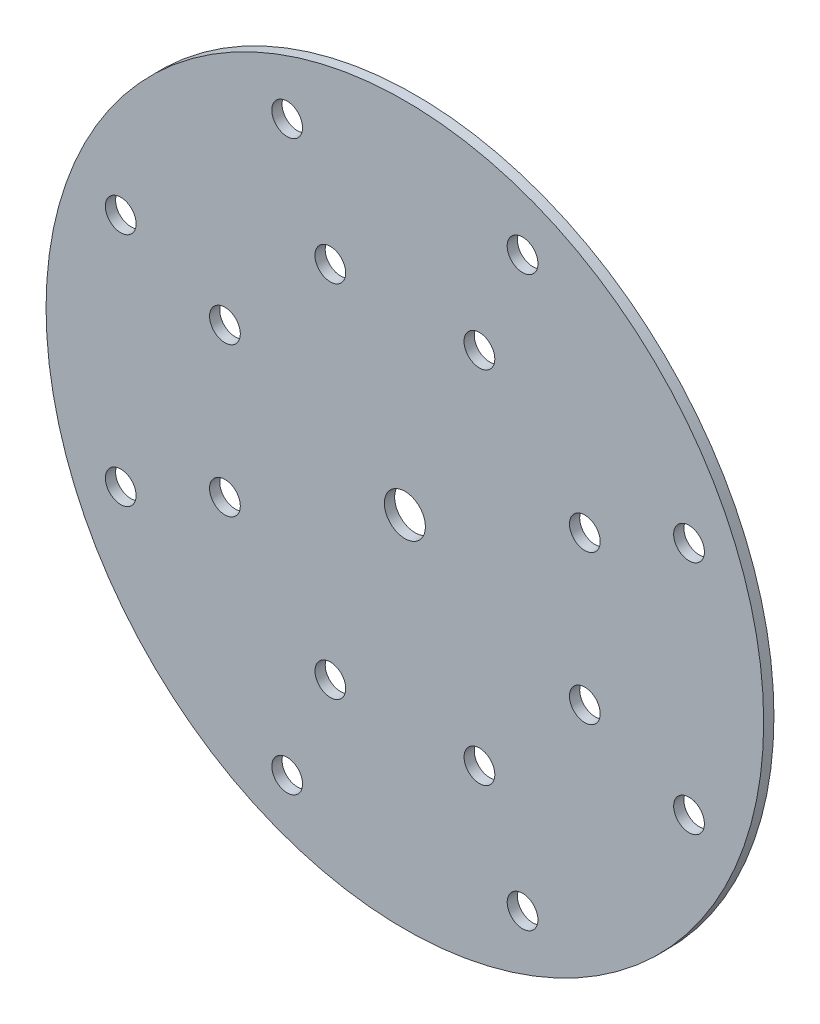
ISO-10303-21;
HEADER;
FILE_DESCRIPTION(('STEP AP214'),'2;1');
FILE_NAME('part.step','',(''),(''),'','','');
FILE_SCHEMA(('AUTOMOTIVE_DESIGN { 1 0 10303 214 1 1 1 1 }'));
ENDSEC;
DATA;
#1=APPLICATION_CONTEXT('core data for automotive mechanical design processes');
#2=APPLICATION_PROTOCOL_DEFINITION('international standard','automotive_design',2000,#1);
#3=PRODUCT_CONTEXT('',#1,'mechanical');
#4=PRODUCT('Part','Part','',(#3));
#5=PRODUCT_RELATED_PRODUCT_CATEGORY('part','',(#4));
#6=PRODUCT_DEFINITION_FORMATION('','',#4);
#7=PRODUCT_DEFINITION_CONTEXT('part definition',#1,'design');
#8=PRODUCT_DEFINITION('design','',#6,#7);
#9=PRODUCT_DEFINITION_SHAPE('','',#8);
#10=(LENGTH_UNIT() NAMED_UNIT(*) SI_UNIT(.MILLI.,.METRE.));
#11=(NAMED_UNIT(*) PLANE_ANGLE_UNIT() SI_UNIT($,.RADIAN.));
#12=(NAMED_UNIT(*) SI_UNIT($,.STERADIAN.) SOLID_ANGLE_UNIT());
#13=UNCERTAINTY_MEASURE_WITH_UNIT(LENGTH_MEASURE(1.E-05),#10,'distance_accuracy_value','');
#14=(GEOMETRIC_REPRESENTATION_CONTEXT(3) GLOBAL_UNCERTAINTY_ASSIGNED_CONTEXT((#13)) GLOBAL_UNIT_ASSIGNED_CONTEXT((#10,
#11,#12)) REPRESENTATION_CONTEXT('',''));
#15=CARTESIAN_POINT('',(0.,0.,0.));
#16=DIRECTION('',(0.,0.,1.));
#17=DIRECTION('',(1.,0.,0.));
#18=AXIS2_PLACEMENT_3D('',#15,#16,#17);
#19=CARTESIAN_POINT('',(0.,0.,1.));
#20=DIRECTION('',(0.,0.,1.));
#21=DIRECTION('',(1.,0.,0.));
#22=AXIS2_PLACEMENT_3D('',#19,#20,#21);
#23=PLANE('',#22);
#24=CARTESIAN_POINT('',(-17.5541191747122,7.27000000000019,1.));
#25=DIRECTION('',(0.,0.,-1.));
#26=DIRECTION('',(-1.,0.,0.));
#27=AXIS2_PLACEMENT_3D('',#24,#25,#26);
#28=CIRCLE('',#27,1.5);
#29=CARTESIAN_POINT('',(-19.0541191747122,7.27000000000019,1.));
#30=VERTEX_POINT('',#29);
#31=EDGE_CURVE('E132',#30,#30,#28,.T.);
#32=ORIENTED_EDGE('',*,*,#31,.T.);
#33=EDGE_LOOP('',(#32));
#34=FACE_BOUND('',#33,.T.);
#35=CARTESIAN_POINT('',(-7.27,-17.5541191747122,1.));
#36=DIRECTION('',(0.,0.,-1.));
#37=DIRECTION('',(-1.,0.,0.));
#38=AXIS2_PLACEMENT_3D('',#35,#36,#37);
#39=CIRCLE('',#38,1.5);
#40=CARTESIAN_POINT('',(-8.77,-17.5541191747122,1.));
#41=VERTEX_POINT('',#40);
#42=EDGE_CURVE('E120',#41,#41,#39,.T.);
#43=ORIENTED_EDGE('',*,*,#42,.T.);
#44=EDGE_LOOP('',(#43));
#45=FACE_BOUND('',#44,.T.);
#46=CARTESIAN_POINT('',(7.27197040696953,-17.5533030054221,1.));
#47=DIRECTION('',(0.,0.,-1.));
#48=DIRECTION('',(-1.,0.,0.));
#49=AXIS2_PLACEMENT_3D('',#46,#47,#48);
#50=CIRCLE('',#49,1.5);
#51=CARTESIAN_POINT('',(5.77197040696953,-17.5533030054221,1.));
#52=VERTEX_POINT('',#51);
#53=EDGE_CURVE('E114',#52,#52,#50,.T.);
#54=ORIENTED_EDGE('',*,*,#53,.T.);
#55=EDGE_LOOP('',(#54));
#56=FACE_BOUND('',#55,.T.);
#57=CARTESIAN_POINT('',(0.,0.,1.));
#58=DIRECTION('',(0.,0.,1.));
#59=DIRECTION('',(1.,0.,0.));
#60=AXIS2_PLACEMENT_3D('',#57,#58,#59);
#61=CIRCLE('',#60,35.);
#62=CARTESIAN_POINT('',(35.,0.,1.));
#63=VERTEX_POINT('',#62);
#64=EDGE_CURVE('E10',#63,#63,#61,.T.);
#65=ORIENTED_EDGE('',*,*,#64,.T.);
#66=EDGE_LOOP('',(#65));
#67=FACE_BOUND('',#66,.T.);
#68=CARTESIAN_POINT('',(0.,0.,1.));
#69=DIRECTION('',(0.,0.,1.));
#70=DIRECTION('',(1.,0.,0.));
#71=AXIS2_PLACEMENT_3D('',#68,#69,#70);
#72=CIRCLE('',#71,2.);
#73=CARTESIAN_POINT('',(2.,0.,1.));
#74=VERTEX_POINT('',#73);
#75=EDGE_CURVE('E43',#74,#74,#72,.T.);
#76=ORIENTED_EDGE('',*,*,#75,.F.);
#77=EDGE_LOOP('',(#76));
#78=FACE_BOUND('',#77,.T.);
#79=CARTESIAN_POINT('',(-11.4805,27.7163872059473,1.));
#80=DIRECTION('',(0.,0.,1.));
#81=DIRECTION('',(1.,0.,0.));
#82=AXIS2_PLACEMENT_3D('',#79,#80,#81);
#83=CIRCLE('',#82,1.49999999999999);
#84=CARTESIAN_POINT('',(-9.98050000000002,27.7163872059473,1.));
#85=VERTEX_POINT('',#84);
#86=EDGE_CURVE('E51',#85,#85,#83,.T.);
#87=ORIENTED_EDGE('',*,*,#86,.F.);
#88=EDGE_LOOP('',(#87));
#89=FACE_BOUND('',#88,.T.);
#90=CARTESIAN_POINT('',(-27.7163847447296,11.4805059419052,1.));
#91=DIRECTION('',(0.,0.,1.));
#92=DIRECTION('',(1.,0.,0.));
#93=AXIS2_PLACEMENT_3D('',#90,#91,#92);
#94=CIRCLE('',#93,1.49999999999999);
#95=CARTESIAN_POINT('',(-26.2163847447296,11.4805059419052,1.));
#96=VERTEX_POINT('',#95);
#97=EDGE_CURVE('E57',#96,#96,#94,.T.);
#98=ORIENTED_EDGE('',*,*,#97,.F.);
#99=EDGE_LOOP('',(#98));
#100=FACE_BOUND('',#99,.T.);
#101=CARTESIAN_POINT('',(-27.7163872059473,-11.4805000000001,1.));
#102=DIRECTION('',(0.,0.,1.));
#103=DIRECTION('',(1.,0.,0.));
#104=AXIS2_PLACEMENT_3D('',#101,#102,#103);
#105=CIRCLE('',#104,1.49999999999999);
#106=CARTESIAN_POINT('',(-26.2163872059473,-11.4805000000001,1.));
#107=VERTEX_POINT('',#106);
#108=EDGE_CURVE('E63',#107,#107,#105,.T.);
#109=ORIENTED_EDGE('',*,*,#108,.F.);
#110=EDGE_LOOP('',(#109));
#111=FACE_BOUND('',#110,.T.);
#112=CARTESIAN_POINT('',(-11.4805059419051,-27.7163847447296,1.));
#113=DIRECTION('',(0.,0.,1.));
#114=DIRECTION('',(1.,0.,0.));
#115=AXIS2_PLACEMENT_3D('',#112,#113,#114);
#116=CIRCLE('',#115,1.49999999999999);
#117=CARTESIAN_POINT('',(-9.98050594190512,-27.7163847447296,1.));
#118=VERTEX_POINT('',#117);
#119=EDGE_CURVE('E69',#118,#118,#116,.T.);
#120=ORIENTED_EDGE('',*,*,#119,.F.);
#121=EDGE_LOOP('',(#120));
#122=FACE_BOUND('',#121,.T.);
#123=CARTESIAN_POINT('',(11.4805,-27.7163872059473,1.));
#124=DIRECTION('',(0.,0.,1.));
#125=DIRECTION('',(1.,0.,0.));
#126=AXIS2_PLACEMENT_3D('',#123,#124,#125);
#127=CIRCLE('',#126,1.49999999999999);
#128=CARTESIAN_POINT('',(12.9805,-27.7163872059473,1.));
#129=VERTEX_POINT('',#128);
#130=EDGE_CURVE('E75',#129,#129,#127,.T.);
#131=ORIENTED_EDGE('',*,*,#130,.F.);
#132=EDGE_LOOP('',(#131));
#133=FACE_BOUND('',#132,.T.);
#134=CARTESIAN_POINT('',(27.7163847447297,-11.480505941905,1.));
#135=DIRECTION('',(0.,0.,1.));
#136=DIRECTION('',(1.,0.,0.));
#137=AXIS2_PLACEMENT_3D('',#134,#135,#136);
#138=CIRCLE('',#137,1.49999999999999);
#139=CARTESIAN_POINT('',(29.2163847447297,-11.480505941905,1.));
#140=VERTEX_POINT('',#139);
#141=EDGE_CURVE('E81',#140,#140,#138,.T.);
#142=ORIENTED_EDGE('',*,*,#141,.F.);
#143=EDGE_LOOP('',(#142));
#144=FACE_BOUND('',#143,.T.);
#145=CARTESIAN_POINT('',(27.7163872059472,11.4805000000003,1.));
#146=DIRECTION('',(0.,0.,1.));
#147=DIRECTION('',(1.,0.,0.));
#148=AXIS2_PLACEMENT_3D('',#145,#146,#147);
#149=CIRCLE('',#148,1.49999999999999);
#150=CARTESIAN_POINT('',(29.2163872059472,11.4805000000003,1.));
#151=VERTEX_POINT('',#150);
#152=EDGE_CURVE('E87',#151,#151,#149,.T.);
#153=ORIENTED_EDGE('',*,*,#152,.F.);
#154=EDGE_LOOP('',(#153));
#155=FACE_BOUND('',#154,.T.);
#156=CARTESIAN_POINT('',(11.4805059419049,27.7163847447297,1.));
#157=DIRECTION('',(0.,0.,1.));
#158=DIRECTION('',(1.,0.,0.));
#159=AXIS2_PLACEMENT_3D('',#156,#157,#158);
#160=CIRCLE('',#159,1.49999999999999);
#161=CARTESIAN_POINT('',(12.9805059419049,27.7163847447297,1.));
#162=VERTEX_POINT('',#161);
#163=EDGE_CURVE('E93',#162,#162,#160,.T.);
#164=ORIENTED_EDGE('',*,*,#163,.F.);
#165=EDGE_LOOP('',(#164));
#166=FACE_BOUND('',#165,.T.);
#167=CARTESIAN_POINT('',(7.27,17.5541191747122,1.));
#168=DIRECTION('',(0.,0.,-1.));
#169=DIRECTION('',(-1.,0.,0.));
#170=AXIS2_PLACEMENT_3D('',#167,#168,#169);
#171=CIRCLE('',#170,1.5);
#172=CARTESIAN_POINT('',(5.77,17.5541191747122,1.));
#173=VERTEX_POINT('',#172);
#174=EDGE_CURVE('E96',#173,#173,#171,.T.);
#175=ORIENTED_EDGE('',*,*,#174,.T.);
#176=EDGE_LOOP('',(#175));
#177=FACE_BOUND('',#176,.T.);
#178=CARTESIAN_POINT('',(17.553303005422,7.2719704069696,1.));
#179=DIRECTION('',(0.,0.,-1.));
#180=DIRECTION('',(-1.,0.,0.));
#181=AXIS2_PLACEMENT_3D('',#178,#179,#180);
#182=CIRCLE('',#181,1.5);
#183=CARTESIAN_POINT('',(16.053303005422,7.2719704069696,1.));
#184=VERTEX_POINT('',#183);
#185=EDGE_CURVE('E102',#184,#184,#182,.T.);
#186=ORIENTED_EDGE('',*,*,#185,.T.);
#187=EDGE_LOOP('',(#186));
#188=FACE_BOUND('',#187,.T.);
#189=CARTESIAN_POINT('',(17.5541191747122,-7.27000000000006,1.));
#190=DIRECTION('',(0.,0.,-1.));
#191=DIRECTION('',(-1.,0.,0.));
#192=AXIS2_PLACEMENT_3D('',#189,#190,#191);
#193=CIRCLE('',#192,1.5);
#194=CARTESIAN_POINT('',(16.0541191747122,-7.27000000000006,1.));
#195=VERTEX_POINT('',#194);
#196=EDGE_CURVE('E108',#195,#195,#193,.T.);
#197=ORIENTED_EDGE('',*,*,#196,.T.);
#198=EDGE_LOOP('',(#197));
#199=FACE_BOUND('',#198,.T.);
#200=CARTESIAN_POINT('',(-17.5533030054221,-7.27197040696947,1.));
#201=DIRECTION('',(0.,0.,-1.));
#202=DIRECTION('',(-1.,0.,0.));
#203=AXIS2_PLACEMENT_3D('',#200,#201,#202);
#204=CIRCLE('',#203,1.5);
#205=CARTESIAN_POINT('',(-19.0533030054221,-7.27197040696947,1.));
#206=VERTEX_POINT('',#205);
#207=EDGE_CURVE('E126',#206,#206,#204,.T.);
#208=ORIENTED_EDGE('',*,*,#207,.T.);
#209=EDGE_LOOP('',(#208));
#210=FACE_BOUND('',#209,.T.);
#211=CARTESIAN_POINT('',(-7.27197040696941,17.5533030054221,1.));
#212=DIRECTION('',(0.,0.,-1.));
#213=DIRECTION('',(-1.,0.,0.));
#214=AXIS2_PLACEMENT_3D('',#211,#212,#213);
#215=CIRCLE('',#214,1.5);
#216=CARTESIAN_POINT('',(-8.77197040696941,17.5533030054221,1.));
#217=VERTEX_POINT('',#216);
#218=EDGE_CURVE('E138',#217,#217,#215,.T.);
#219=ORIENTED_EDGE('',*,*,#218,.T.);
#220=EDGE_LOOP('',(#219));
#221=FACE_BOUND('',#220,.T.);
#222=ADVANCED_FACE('F30',(#34,#45,#56,#67,#78,#89,#100,#111,#122,#133,#144,#155,#166,#177,#188,
#199,#210,#221),#23,.T.);
#223=CARTESIAN_POINT('',(0.,0.,0.));
#224=DIRECTION('',(0.,0.,1.));
#225=DIRECTION('',(1.,0.,0.));
#226=AXIS2_PLACEMENT_3D('',#223,#224,#225);
#227=PLANE('',#226);
#228=CARTESIAN_POINT('',(-7.27197040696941,17.5533030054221,0.));
#229=DIRECTION('',(0.,0.,-1.));
#230=DIRECTION('',(-1.,0.,0.));
#231=AXIS2_PLACEMENT_3D('',#228,#229,#230);
#232=CIRCLE('',#231,1.49999999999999);
#233=CARTESIAN_POINT('',(-8.7719704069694,17.5533030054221,0.));
#234=VERTEX_POINT('',#233);
#235=EDGE_CURVE('E141',#234,#234,#232,.T.);
#236=ORIENTED_EDGE('',*,*,#235,.F.);
#237=EDGE_LOOP('',(#236));
#238=FACE_BOUND('',#237,.T.);
#239=CARTESIAN_POINT('',(-17.5533030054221,-7.27197040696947,0.));
#240=DIRECTION('',(0.,0.,-1.));
#241=DIRECTION('',(-1.,0.,0.));
#242=AXIS2_PLACEMENT_3D('',#239,#240,#241);
#243=CIRCLE('',#242,1.49999999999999);
#244=CARTESIAN_POINT('',(-19.0533030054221,-7.27197040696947,0.));
#245=VERTEX_POINT('',#244);
#246=EDGE_CURVE('E129',#245,#245,#243,.T.);
#247=ORIENTED_EDGE('',*,*,#246,.F.);
#248=EDGE_LOOP('',(#247));
#249=FACE_BOUND('',#248,.T.);
#250=CARTESIAN_POINT('',(7.27197040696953,-17.5533030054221,0.));
#251=DIRECTION('',(0.,0.,-1.));
#252=DIRECTION('',(-1.,0.,0.));
#253=AXIS2_PLACEMENT_3D('',#250,#251,#252);
#254=CIRCLE('',#253,1.49999999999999);
#255=CARTESIAN_POINT('',(5.77197040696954,-17.5533030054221,0.));
#256=VERTEX_POINT('',#255);
#257=EDGE_CURVE('E117',#256,#256,#254,.T.);
#258=ORIENTED_EDGE('',*,*,#257,.F.);
#259=EDGE_LOOP('',(#258));
#260=FACE_BOUND('',#259,.T.);
#261=CARTESIAN_POINT('',(17.5541191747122,-7.27000000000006,0.));
#262=DIRECTION('',(0.,0.,-1.));
#263=DIRECTION('',(-1.,0.,0.));
#264=AXIS2_PLACEMENT_3D('',#261,#262,#263);
#265=CIRCLE('',#264,1.49999999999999);
#266=CARTESIAN_POINT('',(16.0541191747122,-7.27000000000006,0.));
#267=VERTEX_POINT('',#266);
#268=EDGE_CURVE('E111',#267,#267,#265,.T.);
#269=ORIENTED_EDGE('',*,*,#268,.F.);
#270=EDGE_LOOP('',(#269));
#271=FACE_BOUND('',#270,.T.);
#272=CARTESIAN_POINT('',(0.,0.,0.));
#273=DIRECTION('',(0.,0.,1.));
#274=DIRECTION('',(1.,0.,0.));
#275=AXIS2_PLACEMENT_3D('',#272,#273,#274);
#276=CIRCLE('',#275,35.);
#277=CARTESIAN_POINT('',(35.,0.,0.));
#278=VERTEX_POINT('',#277);
#279=EDGE_CURVE('E34',#278,#278,#276,.T.);
#280=ORIENTED_EDGE('',*,*,#279,.F.);
#281=EDGE_LOOP('',(#280));
#282=FACE_BOUND('',#281,.T.);
#283=CARTESIAN_POINT('',(0.,0.,0.));
#284=DIRECTION('',(0.,0.,1.));
#285=DIRECTION('',(1.,0.,0.));
#286=AXIS2_PLACEMENT_3D('',#283,#284,#285);
#287=CIRCLE('',#286,2.);
#288=CARTESIAN_POINT('',(2.,0.,0.));
#289=VERTEX_POINT('',#288);
#290=EDGE_CURVE('E41',#289,#289,#287,.T.);
#291=ORIENTED_EDGE('',*,*,#290,.T.);
#292=EDGE_LOOP('',(#291));
#293=FACE_BOUND('',#292,.T.);
#294=CARTESIAN_POINT('',(-11.4805,27.7163872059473,0.));
#295=DIRECTION('',(0.,0.,1.));
#296=DIRECTION('',(1.,0.,0.));
#297=AXIS2_PLACEMENT_3D('',#294,#295,#296);
#298=CIRCLE('',#297,1.49999999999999);
#299=CARTESIAN_POINT('',(-9.98050000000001,27.7163872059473,0.));
#300=VERTEX_POINT('',#299);
#301=EDGE_CURVE('E46',#300,#300,#298,.T.);
#302=ORIENTED_EDGE('',*,*,#301,.T.);
#303=EDGE_LOOP('',(#302));
#304=FACE_BOUND('',#303,.T.);
#305=CARTESIAN_POINT('',(-27.7163847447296,11.4805059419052,0.));
#306=DIRECTION('',(0.,0.,1.));
#307=DIRECTION('',(1.,0.,0.));
#308=AXIS2_PLACEMENT_3D('',#305,#306,#307);
#309=CIRCLE('',#308,1.49999999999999);
#310=CARTESIAN_POINT('',(-26.2163847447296,11.4805059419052,0.));
#311=VERTEX_POINT('',#310);
#312=EDGE_CURVE('E54',#311,#311,#309,.T.);
#313=ORIENTED_EDGE('',*,*,#312,.T.);
#314=EDGE_LOOP('',(#313));
#315=FACE_BOUND('',#314,.T.);
#316=CARTESIAN_POINT('',(-27.7163872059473,-11.4805000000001,0.));
#317=DIRECTION('',(0.,0.,1.));
#318=DIRECTION('',(1.,0.,0.));
#319=AXIS2_PLACEMENT_3D('',#316,#317,#318);
#320=CIRCLE('',#319,1.49999999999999);
#321=CARTESIAN_POINT('',(-26.2163872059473,-11.4805000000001,0.));
#322=VERTEX_POINT('',#321);
#323=EDGE_CURVE('E60',#322,#322,#320,.T.);
#324=ORIENTED_EDGE('',*,*,#323,.T.);
#325=EDGE_LOOP('',(#324));
#326=FACE_BOUND('',#325,.T.);
#327=CARTESIAN_POINT('',(-11.4805059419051,-27.7163847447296,0.));
#328=DIRECTION('',(0.,0.,1.));
#329=DIRECTION('',(1.,0.,0.));
#330=AXIS2_PLACEMENT_3D('',#327,#328,#329);
#331=CIRCLE('',#330,1.49999999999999);
#332=CARTESIAN_POINT('',(-9.98050594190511,-27.7163847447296,0.));
#333=VERTEX_POINT('',#332);
#334=EDGE_CURVE('E66',#333,#333,#331,.T.);
#335=ORIENTED_EDGE('',*,*,#334,.T.);
#336=EDGE_LOOP('',(#335));
#337=FACE_BOUND('',#336,.T.);
#338=CARTESIAN_POINT('',(11.4805,-27.7163872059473,0.));
#339=DIRECTION('',(0.,0.,1.));
#340=DIRECTION('',(1.,0.,0.));
#341=AXIS2_PLACEMENT_3D('',#338,#339,#340);
#342=CIRCLE('',#341,1.49999999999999);
#343=CARTESIAN_POINT('',(12.9805,-27.7163872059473,0.));
#344=VERTEX_POINT('',#343);
#345=EDGE_CURVE('E72',#344,#344,#342,.T.);
#346=ORIENTED_EDGE('',*,*,#345,.T.);
#347=EDGE_LOOP('',(#346));
#348=FACE_BOUND('',#347,.T.);
#349=CARTESIAN_POINT('',(27.7163847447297,-11.480505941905,0.));
#350=DIRECTION('',(0.,0.,1.));
#351=DIRECTION('',(1.,0.,0.));
#352=AXIS2_PLACEMENT_3D('',#349,#350,#351);
#353=CIRCLE('',#352,1.49999999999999);
#354=CARTESIAN_POINT('',(29.2163847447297,-11.480505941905,0.));
#355=VERTEX_POINT('',#354);
#356=EDGE_CURVE('E78',#355,#355,#353,.T.);
#357=ORIENTED_EDGE('',*,*,#356,.T.);
#358=EDGE_LOOP('',(#357));
#359=FACE_BOUND('',#358,.T.);
#360=CARTESIAN_POINT('',(27.7163872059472,11.4805000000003,0.));
#361=DIRECTION('',(0.,0.,1.));
#362=DIRECTION('',(1.,0.,0.));
#363=AXIS2_PLACEMENT_3D('',#360,#361,#362);
#364=CIRCLE('',#363,1.49999999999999);
#365=CARTESIAN_POINT('',(29.2163872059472,11.4805000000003,0.));
#366=VERTEX_POINT('',#365);
#367=EDGE_CURVE('E84',#366,#366,#364,.T.);
#368=ORIENTED_EDGE('',*,*,#367,.T.);
#369=EDGE_LOOP('',(#368));
#370=FACE_BOUND('',#369,.T.);
#371=CARTESIAN_POINT('',(11.4805059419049,27.7163847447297,0.));
#372=DIRECTION('',(0.,0.,1.));
#373=DIRECTION('',(1.,0.,0.));
#374=AXIS2_PLACEMENT_3D('',#371,#372,#373);
#375=CIRCLE('',#374,1.49999999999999);
#376=CARTESIAN_POINT('',(12.9805059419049,27.7163847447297,0.));
#377=VERTEX_POINT('',#376);
#378=EDGE_CURVE('E90',#377,#377,#375,.T.);
#379=ORIENTED_EDGE('',*,*,#378,.T.);
#380=EDGE_LOOP('',(#379));
#381=FACE_BOUND('',#380,.T.);
#382=CARTESIAN_POINT('',(7.27,17.5541191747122,0.));
#383=DIRECTION('',(0.,0.,-1.));
#384=DIRECTION('',(-1.,0.,0.));
#385=AXIS2_PLACEMENT_3D('',#382,#383,#384);
#386=CIRCLE('',#385,1.49999999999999);
#387=CARTESIAN_POINT('',(5.77000000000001,17.5541191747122,0.));
#388=VERTEX_POINT('',#387);
#389=EDGE_CURVE('E99',#388,#388,#386,.T.);
#390=ORIENTED_EDGE('',*,*,#389,.F.);
#391=EDGE_LOOP('',(#390));
#392=FACE_BOUND('',#391,.T.);
#393=CARTESIAN_POINT('',(17.553303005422,7.2719704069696,0.));
#394=DIRECTION('',(0.,0.,-1.));
#395=DIRECTION('',(-1.,0.,0.));
#396=AXIS2_PLACEMENT_3D('',#393,#394,#395);
#397=CIRCLE('',#396,1.49999999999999);
#398=CARTESIAN_POINT('',(16.0533030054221,7.2719704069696,0.));
#399=VERTEX_POINT('',#398);
#400=EDGE_CURVE('E105',#399,#399,#397,.T.);
#401=ORIENTED_EDGE('',*,*,#400,.F.);
#402=EDGE_LOOP('',(#401));
#403=FACE_BOUND('',#402,.T.);
#404=CARTESIAN_POINT('',(-7.27,-17.5541191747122,0.));
#405=DIRECTION('',(0.,0.,-1.));
#406=DIRECTION('',(-1.,0.,0.));
#407=AXIS2_PLACEMENT_3D('',#404,#405,#406);
#408=CIRCLE('',#407,1.49999999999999);
#409=CARTESIAN_POINT('',(-8.76999999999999,-17.5541191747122,0.));
#410=VERTEX_POINT('',#409);
#411=EDGE_CURVE('E123',#410,#410,#408,.T.);
#412=ORIENTED_EDGE('',*,*,#411,.F.);
#413=EDGE_LOOP('',(#412));
#414=FACE_BOUND('',#413,.T.);
#415=CARTESIAN_POINT('',(-17.5541191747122,7.27000000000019,0.));
#416=DIRECTION('',(0.,0.,-1.));
#417=DIRECTION('',(-1.,0.,0.));
#418=AXIS2_PLACEMENT_3D('',#415,#416,#417);
#419=CIRCLE('',#418,1.49999999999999);
#420=CARTESIAN_POINT('',(-19.0541191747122,7.27000000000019,0.));
#421=VERTEX_POINT('',#420);
#422=EDGE_CURVE('E135',#421,#421,#419,.T.);
#423=ORIENTED_EDGE('',*,*,#422,.F.);
#424=EDGE_LOOP('',(#423));
#425=FACE_BOUND('',#424,.T.);
#426=ADVANCED_FACE('F147',(#238,#249,#260,#271,#282,#293,#304,#315,#326,#337,#348,#359,#370,
#381,#392,#403,#414,#425),#227,.F.);
#427=CARTESIAN_POINT('',(0.,0.,1.));
#428=DIRECTION('',(0.,0.,-1.));
#429=DIRECTION('',(-1.,0.,0.));
#430=AXIS2_PLACEMENT_3D('',#427,#428,#429);
#431=CYLINDRICAL_SURFACE('',#430,35.);
#432=ORIENTED_EDGE('',*,*,#64,.F.);
#433=EDGE_LOOP('',(#432));
#434=FACE_BOUND('',#433,.T.);
#435=ORIENTED_EDGE('',*,*,#279,.T.);
#436=EDGE_LOOP('',(#435));
#437=FACE_BOUND('',#436,.T.);
#438=ADVANCED_FACE('F32',(#434,#437),#431,.T.);
#439=CARTESIAN_POINT('',(0.,0.,0.));
#440=DIRECTION('',(0.,0.,1.));
#441=DIRECTION('',(1.,0.,0.));
#442=AXIS2_PLACEMENT_3D('',#439,#440,#441);
#443=CYLINDRICAL_SURFACE('',#442,2.);
#444=ORIENTED_EDGE('',*,*,#290,.F.);
#445=EDGE_LOOP('',(#444));
#446=FACE_BOUND('',#445,.T.);
#447=ORIENTED_EDGE('',*,*,#75,.T.);
#448=EDGE_LOOP('',(#447));
#449=FACE_BOUND('',#448,.T.);
#450=ADVANCED_FACE('F206',(#446,#449),#443,.F.);
#451=CARTESIAN_POINT('',(-11.4805,27.7163872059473,1.));
#452=DIRECTION('',(0.,0.,1.));
#453=DIRECTION('',(1.,0.,0.));
#454=AXIS2_PLACEMENT_3D('',#451,#452,#453);
#455=CYLINDRICAL_SURFACE('',#454,1.49999999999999);
#456=ORIENTED_EDGE('',*,*,#301,.F.);
#457=EDGE_LOOP('',(#456));
#458=FACE_BOUND('',#457,.T.);
#459=ORIENTED_EDGE('',*,*,#86,.T.);
#460=EDGE_LOOP('',(#459));
#461=FACE_BOUND('',#460,.T.);
#462=ADVANCED_FACE('F209',(#458,#461),#455,.F.);
#463=CARTESIAN_POINT('',(-27.7163847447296,11.4805059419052,1.));
#464=DIRECTION('',(0.,0.,1.));
#465=DIRECTION('',(1.,0.,0.));
#466=AXIS2_PLACEMENT_3D('',#463,#464,#465);
#467=CYLINDRICAL_SURFACE('',#466,1.49999999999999);
#468=ORIENTED_EDGE('',*,*,#312,.F.);
#469=EDGE_LOOP('',(#468));
#470=FACE_BOUND('',#469,.T.);
#471=ORIENTED_EDGE('',*,*,#97,.T.);
#472=EDGE_LOOP('',(#471));
#473=FACE_BOUND('',#472,.T.);
#474=ADVANCED_FACE('F213',(#470,#473),#467,.F.);
#475=CARTESIAN_POINT('',(-27.7163872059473,-11.4805000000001,1.));
#476=DIRECTION('',(0.,0.,1.));
#477=DIRECTION('',(1.,0.,0.));
#478=AXIS2_PLACEMENT_3D('',#475,#476,#477);
#479=CYLINDRICAL_SURFACE('',#478,1.49999999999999);
#480=ORIENTED_EDGE('',*,*,#323,.F.);
#481=EDGE_LOOP('',(#480));
#482=FACE_BOUND('',#481,.T.);
#483=ORIENTED_EDGE('',*,*,#108,.T.);
#484=EDGE_LOOP('',(#483));
#485=FACE_BOUND('',#484,.T.);
#486=ADVANCED_FACE('F217',(#482,#485),#479,.F.);
#487=CARTESIAN_POINT('',(-11.4805059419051,-27.7163847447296,1.));
#488=DIRECTION('',(0.,0.,1.));
#489=DIRECTION('',(1.,0.,0.));
#490=AXIS2_PLACEMENT_3D('',#487,#488,#489);
#491=CYLINDRICAL_SURFACE('',#490,1.49999999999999);
#492=ORIENTED_EDGE('',*,*,#334,.F.);
#493=EDGE_LOOP('',(#492));
#494=FACE_BOUND('',#493,.T.);
#495=ORIENTED_EDGE('',*,*,#119,.T.);
#496=EDGE_LOOP('',(#495));
#497=FACE_BOUND('',#496,.T.);
#498=ADVANCED_FACE('F221',(#494,#497),#491,.F.);
#499=CARTESIAN_POINT('',(11.4805,-27.7163872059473,1.));
#500=DIRECTION('',(0.,0.,1.));
#501=DIRECTION('',(1.,0.,0.));
#502=AXIS2_PLACEMENT_3D('',#499,#500,#501);
#503=CYLINDRICAL_SURFACE('',#502,1.49999999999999);
#504=ORIENTED_EDGE('',*,*,#345,.F.);
#505=EDGE_LOOP('',(#504));
#506=FACE_BOUND('',#505,.T.);
#507=ORIENTED_EDGE('',*,*,#130,.T.);
#508=EDGE_LOOP('',(#507));
#509=FACE_BOUND('',#508,.T.);
#510=ADVANCED_FACE('F225',(#506,#509),#503,.F.);
#511=CARTESIAN_POINT('',(27.7163847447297,-11.480505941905,1.));
#512=DIRECTION('',(0.,0.,1.));
#513=DIRECTION('',(1.,0.,0.));
#514=AXIS2_PLACEMENT_3D('',#511,#512,#513);
#515=CYLINDRICAL_SURFACE('',#514,1.49999999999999);
#516=ORIENTED_EDGE('',*,*,#356,.F.);
#517=EDGE_LOOP('',(#516));
#518=FACE_BOUND('',#517,.T.);
#519=ORIENTED_EDGE('',*,*,#141,.T.);
#520=EDGE_LOOP('',(#519));
#521=FACE_BOUND('',#520,.T.);
#522=ADVANCED_FACE('F229',(#518,#521),#515,.F.);
#523=CARTESIAN_POINT('',(27.7163872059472,11.4805000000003,1.));
#524=DIRECTION('',(0.,0.,1.));
#525=DIRECTION('',(1.,0.,0.));
#526=AXIS2_PLACEMENT_3D('',#523,#524,#525);
#527=CYLINDRICAL_SURFACE('',#526,1.49999999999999);
#528=ORIENTED_EDGE('',*,*,#367,.F.);
#529=EDGE_LOOP('',(#528));
#530=FACE_BOUND('',#529,.T.);
#531=ORIENTED_EDGE('',*,*,#152,.T.);
#532=EDGE_LOOP('',(#531));
#533=FACE_BOUND('',#532,.T.);
#534=ADVANCED_FACE('F233',(#530,#533),#527,.F.);
#535=CARTESIAN_POINT('',(11.4805059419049,27.7163847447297,1.));
#536=DIRECTION('',(0.,0.,1.));
#537=DIRECTION('',(1.,0.,0.));
#538=AXIS2_PLACEMENT_3D('',#535,#536,#537);
#539=CYLINDRICAL_SURFACE('',#538,1.49999999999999);
#540=ORIENTED_EDGE('',*,*,#378,.F.);
#541=EDGE_LOOP('',(#540));
#542=FACE_BOUND('',#541,.T.);
#543=ORIENTED_EDGE('',*,*,#163,.T.);
#544=EDGE_LOOP('',(#543));
#545=FACE_BOUND('',#544,.T.);
#546=ADVANCED_FACE('F237',(#542,#545),#539,.F.);
#547=CARTESIAN_POINT('',(7.27,17.5541191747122,0.));
#548=DIRECTION('',(0.,0.,-1.));
#549=DIRECTION('',(-1.,0.,0.));
#550=AXIS2_PLACEMENT_3D('',#547,#548,#549);
#551=CYLINDRICAL_SURFACE('',#550,1.49999999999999);
#552=ORIENTED_EDGE('',*,*,#174,.F.);
#553=EDGE_LOOP('',(#552));
#554=FACE_BOUND('',#553,.T.);
#555=ORIENTED_EDGE('',*,*,#389,.T.);
#556=EDGE_LOOP('',(#555));
#557=FACE_BOUND('',#556,.T.);
#558=ADVANCED_FACE('F241',(#554,#557),#551,.F.);
#559=CARTESIAN_POINT('',(17.553303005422,7.2719704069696,0.));
#560=DIRECTION('',(0.,0.,-1.));
#561=DIRECTION('',(-1.,0.,0.));
#562=AXIS2_PLACEMENT_3D('',#559,#560,#561);
#563=CYLINDRICAL_SURFACE('',#562,1.49999999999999);
#564=ORIENTED_EDGE('',*,*,#185,.F.);
#565=EDGE_LOOP('',(#564));
#566=FACE_BOUND('',#565,.T.);
#567=ORIENTED_EDGE('',*,*,#400,.T.);
#568=EDGE_LOOP('',(#567));
#569=FACE_BOUND('',#568,.T.);
#570=ADVANCED_FACE('F245',(#566,#569),#563,.F.);
#571=CARTESIAN_POINT('',(17.5541191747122,-7.27000000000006,0.));
#572=DIRECTION('',(0.,0.,-1.));
#573=DIRECTION('',(-1.,0.,0.));
#574=AXIS2_PLACEMENT_3D('',#571,#572,#573);
#575=CYLINDRICAL_SURFACE('',#574,1.49999999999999);
#576=ORIENTED_EDGE('',*,*,#196,.F.);
#577=EDGE_LOOP('',(#576));
#578=FACE_BOUND('',#577,.T.);
#579=ORIENTED_EDGE('',*,*,#268,.T.);
#580=EDGE_LOOP('',(#579));
#581=FACE_BOUND('',#580,.T.);
#582=ADVANCED_FACE('F249',(#578,#581),#575,.F.);
#583=CARTESIAN_POINT('',(7.27197040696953,-17.5533030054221,0.));
#584=DIRECTION('',(0.,0.,-1.));
#585=DIRECTION('',(-1.,0.,0.));
#586=AXIS2_PLACEMENT_3D('',#583,#584,#585);
#587=CYLINDRICAL_SURFACE('',#586,1.49999999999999);
#588=ORIENTED_EDGE('',*,*,#53,.F.);
#589=EDGE_LOOP('',(#588));
#590=FACE_BOUND('',#589,.T.);
#591=ORIENTED_EDGE('',*,*,#257,.T.);
#592=EDGE_LOOP('',(#591));
#593=FACE_BOUND('',#592,.T.);
#594=ADVANCED_FACE('F253',(#590,#593),#587,.F.);
#595=CARTESIAN_POINT('',(-7.27,-17.5541191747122,0.));
#596=DIRECTION('',(0.,0.,-1.));
#597=DIRECTION('',(-1.,0.,0.));
#598=AXIS2_PLACEMENT_3D('',#595,#596,#597);
#599=CYLINDRICAL_SURFACE('',#598,1.49999999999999);
#600=ORIENTED_EDGE('',*,*,#42,.F.);
#601=EDGE_LOOP('',(#600));
#602=FACE_BOUND('',#601,.T.);
#603=ORIENTED_EDGE('',*,*,#411,.T.);
#604=EDGE_LOOP('',(#603));
#605=FACE_BOUND('',#604,.T.);
#606=ADVANCED_FACE('F195',(#602,#605),#599,.F.);
#607=CARTESIAN_POINT('',(-17.5533030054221,-7.27197040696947,0.));
#608=DIRECTION('',(0.,0.,-1.));
#609=DIRECTION('',(-1.,0.,0.));
#610=AXIS2_PLACEMENT_3D('',#607,#608,#609);
#611=CYLINDRICAL_SURFACE('',#610,1.49999999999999);
#612=ORIENTED_EDGE('',*,*,#207,.F.);
#613=EDGE_LOOP('',(#612));
#614=FACE_BOUND('',#613,.T.);
#615=ORIENTED_EDGE('',*,*,#246,.T.);
#616=EDGE_LOOP('',(#615));
#617=FACE_BOUND('',#616,.T.);
#618=ADVANCED_FACE('F186',(#614,#617),#611,.F.);
#619=CARTESIAN_POINT('',(-17.5541191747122,7.27000000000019,0.));
#620=DIRECTION('',(0.,0.,-1.));
#621=DIRECTION('',(-1.,0.,0.));
#622=AXIS2_PLACEMENT_3D('',#619,#620,#621);
#623=CYLINDRICAL_SURFACE('',#622,1.49999999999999);
#624=ORIENTED_EDGE('',*,*,#31,.F.);
#625=EDGE_LOOP('',(#624));
#626=FACE_BOUND('',#625,.T.);
#627=ORIENTED_EDGE('',*,*,#422,.T.);
#628=EDGE_LOOP('',(#627));
#629=FACE_BOUND('',#628,.T.);
#630=ADVANCED_FACE('F184',(#626,#629),#623,.F.);
#631=CARTESIAN_POINT('',(-7.27197040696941,17.5533030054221,0.));
#632=DIRECTION('',(0.,0.,-1.));
#633=DIRECTION('',(-1.,0.,0.));
#634=AXIS2_PLACEMENT_3D('',#631,#632,#633);
#635=CYLINDRICAL_SURFACE('',#634,1.49999999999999);
#636=ORIENTED_EDGE('',*,*,#218,.F.);
#637=EDGE_LOOP('',(#636));
#638=FACE_BOUND('',#637,.T.);
#639=ORIENTED_EDGE('',*,*,#235,.T.);
#640=EDGE_LOOP('',(#639));
#641=FACE_BOUND('',#640,.T.);
#642=ADVANCED_FACE('F145',(#638,#641),#635,.F.);
#643=CLOSED_SHELL('',(#222,#426,#438,#450,#462,#474,#486,#498,#510,#522,#534,#546,#558,#570,
#582,#594,#606,#618,#630,#642));
#644=MANIFOLD_SOLID_BREP('B2',#643);
#645=ADVANCED_BREP_SHAPE_REPRESENTATION('',(#18,#644),#14);
#646=SHAPE_DEFINITION_REPRESENTATION(#9,#645);
ENDSEC;
END-ISO-10303-21;
